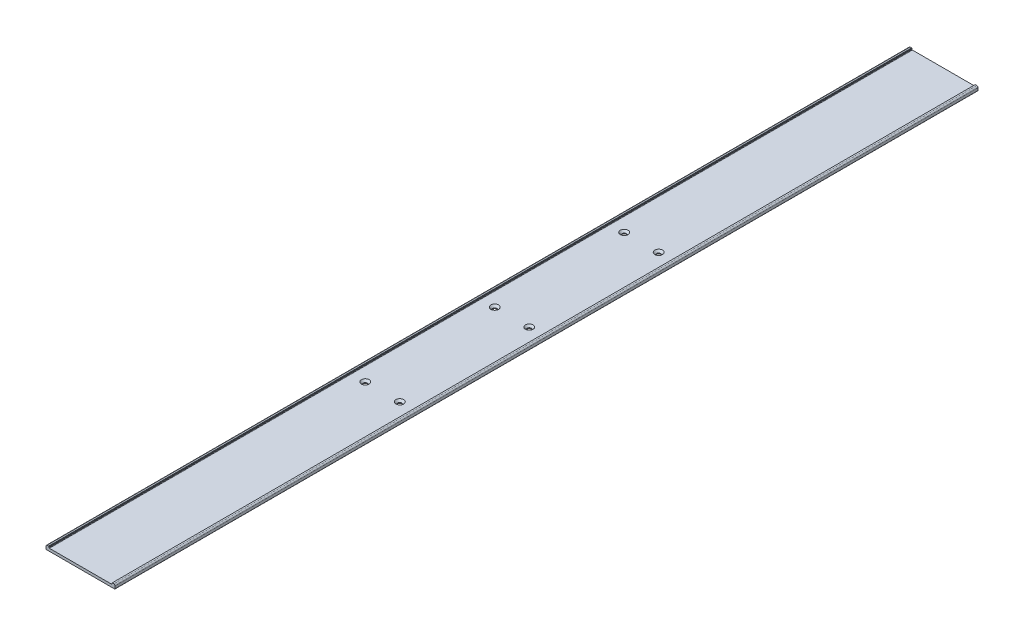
from build123d import *

# Parameters (mm, degrees)
BOSS_EXTRUDE1_DEPTH = 500
LPATTERN1_COUNT     = 2
LPATTERN1_PITCH     = 150
LPATTERN1_COL_COUNT = 2
LPATTERN1_COL_PITCH = 150
LPATTERN2_COUNT     = 2
LPATTERN2_PITCH     = 40


with BuildPart() as part:
    # Sketch1 → Boss-Extrude1 (new, symmetric)
    with BuildSketch(Plane.XY):
        with BuildLine():
            Line((76.75, 4.8), (78.5, 4.8))
            ThreePointArc((78.5, 4.8), (79.560660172, 4.360660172), (80, 3.3))
            Line((80, 3.3), (80, 0.5))
            ThreePointArc((80, 0.5), (79.853553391, 0.146446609), (79.5, 0))
            Line((79.5, 0), (0.5, 0))
            ThreePointArc((0.5, 0), (0.146446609, 0.146446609), (0, 0.5))
            Line((0, 0.5), (0, 3.3))
            ThreePointArc((0, 3.3), (0.439339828, 4.360660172), (1.5, 4.8))
            Line((1.5, 4.8), (3, 4.8))
            Line((3, 4.8), (3.5, 4.3))
            Line((3.5, 4.3), (3.5, 3.6))
            ThreePointArc((3.5, 3.6), (3.646446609, 3.246446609), (4, 3.1))
            Line((4, 3.1), (76, 3.1))
            ThreePointArc((76, 3.1), (76.353553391, 3.246446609), (76.5, 3.6))
            Line((76.5, 3.6), (76.5, 4.55))
            Line((76.5, 4.55), (76.75, 4.8))
        make_face()
    extrude(amount=BOSS_EXTRUDE1_DEPTH, both=True)

    # Sketch4 → CSK for M4 Hex Socket Countersunk Cap Sc (revolve, cut)
    with BuildSketch(Plane(origin=(20, 3.1, 0), x_dir=(0, 0, 1), z_dir=(1, 0, 0))):
        Polygon((0, 0), (0, 39.351936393), (2.25, 38), (2.25, 2.23), (4.48, 0), align=None)
    csk_for_m4_hex_socket_countersunk_cap_sc = revolve(axis=Axis((20, 9.45, 0), (0, -1, 0)), mode=Mode.SUBTRACT)

    # LPattern1: CSK for M4 Hex Socket Countersunk Cap Sc ×2
    with Locations(*[(0, 0, -i * LPATTERN1_PITCH) for i in range(1, LPATTERN1_COUNT)]):
        add(csk_for_m4_hex_socket_countersunk_cap_sc, mode=Mode.SUBTRACT)

    # LPattern1 col: CSK for M4 Hex Socket Countersunk Cap Sc ×2
    with Locations(*[(0, 0, i * LPATTERN1_COL_PITCH) for i in range(1, LPATTERN1_COL_COUNT)]):
        add(csk_for_m4_hex_socket_countersunk_cap_sc, mode=Mode.SUBTRACT)

    # LPattern2: CSK for M4 Hex Socket Countersunk Cap Sc ×2
    with Locations(*[(i * LPATTERN2_PITCH, 0, 0) for i in range(1, LPATTERN2_COUNT)]):
        add(csk_for_m4_hex_socket_countersunk_cap_sc, mode=Mode.SUBTRACT)

    # LPattern2 copy 1 sketch → LPattern2 copy 1 (revolve, cut)
    with BuildSketch(Plane(origin=(60, 3.1, -150), x_dir=(0, 0, 1), z_dir=(1, 0, 0))):
        Polygon((0, 0), (0, 39.351936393), (2.25, 38), (2.25, 2.23), (4.48, 0), align=None)
    revolve(axis=Axis((60, 9.45, -150), (0, -1, 0)), mode=Mode.SUBTRACT)

    # LPattern2 copy 2 sketch → LPattern2 copy 2 (revolve, cut)
    with BuildSketch(Plane(origin=(60, 3.1, 150), x_dir=(0, 0, 1), z_dir=(1, 0, 0))):
        Polygon((0, 0), (0, 39.351936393), (2.25, 38), (2.25, 2.23), (4.48, 0), align=None)
    revolve(axis=Axis((60, 9.45, 150), (0, -1, 0)), mode=Mode.SUBTRACT)


solid = part.part
